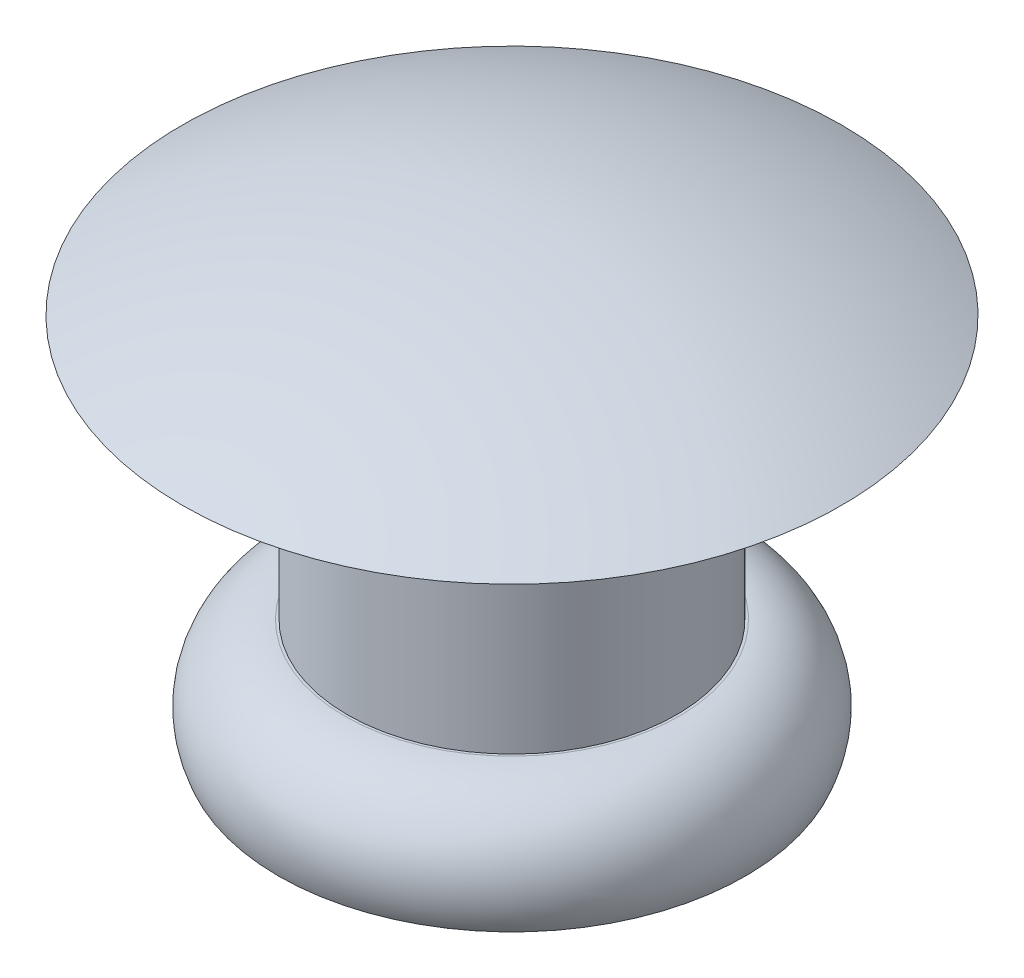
from build123d import *


with BuildPart() as part:
    # Sketch1 → Revolve4 (revolve)
    with BuildSketch(Plane(origin=(0, 0, 0), x_dir=(0, 0, -1), z_dir=(1, 0, 0)), mode=Mode.PRIVATE) as revolve4_sk:
        with BuildLine():
            Line((1.5875, 3.81), (1.5875, 1.27))
            Line((1.5875, 1.27), (1.611705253, 1.27))
            ThreePointArc((1.611705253, 1.27), (2.200407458, 0.931388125), (2.249127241, 0.254))
            Line((2.249127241, 0.254), (0, 0.254))
            Line((0, 0.254), (0, 4.573363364))
            ThreePointArc((0, 4.573363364), (1.632739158, 4.379841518), (3.175, 3.81))
            Line((3.175, 3.81), (1.5875, 3.81))
        make_face()
    revolve(revolve4_sk.sketch.rotate(Axis((0, 4.573363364, 0), (0, -1, 0)), 180), axis=Axis((0, 4.573363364, 0), (0, -1, 0)))


solid = part.part
